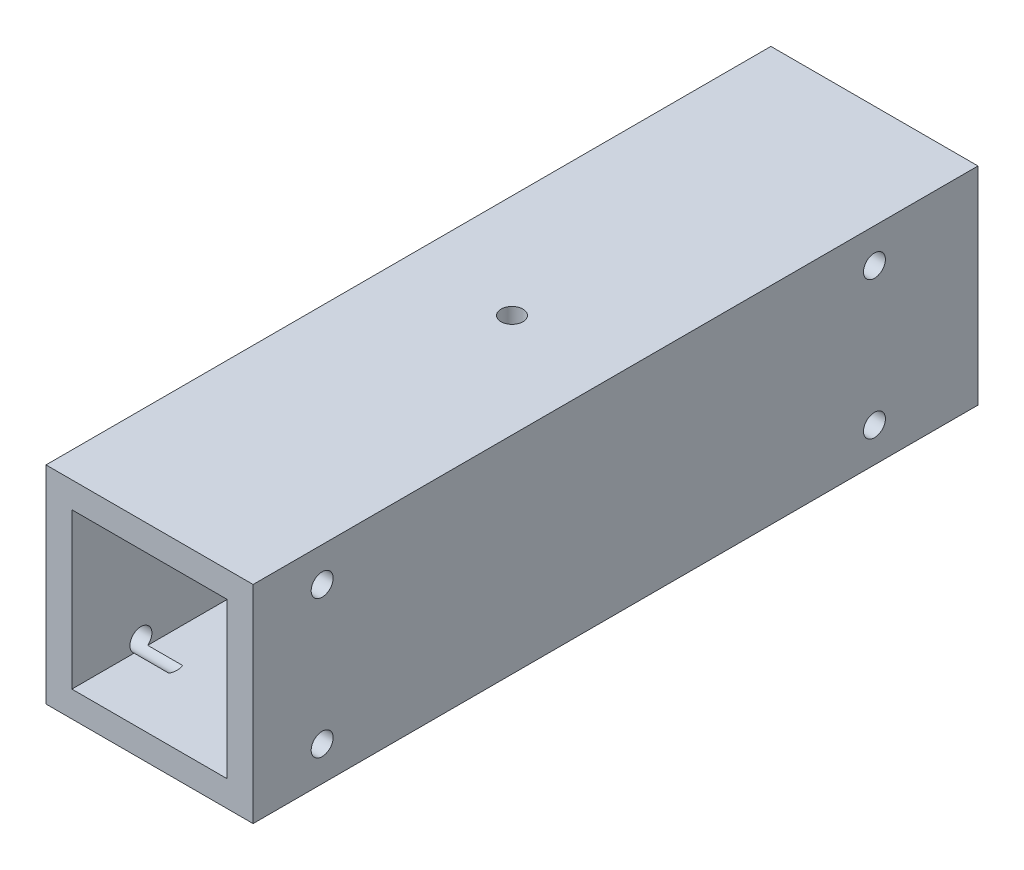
from build123d import *

# Parameters (mm, degrees)
SKETCH1_W                       = 38.1
SKETCH1_H                       = 133.35
BOSS_EXTRUDE1_DEPTH             = 19.05
SKETCH2_W                       = 28.575
SKETCH2_H                       = 28.575
CUT_EXTRUDE1_DEPTH              = 137.044211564
F_10_32_TAPPED_HOLE1_AT_2_COUNT = 2
F_10_32_TAPPED_HOLE1_AT_2_PITCH = 25.4
F_10_32_TAPPED_HOLE1_AT_3_COUNT = 2
F_10_32_TAPPED_HOLE1_AT_3_PITCH = 104.726882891
F_10_32_TAPPED_HOLE1_AT_4_COUNT = 2
F_10_32_TAPPED_HOLE1_AT_4_PITCH = 101.6
F_10_32_TAPPED_HOLE2_D          = 4.0386


with BuildPart() as part:
    # Sketch1 → Boss-Extrude1 (new, symmetric)
    with BuildSketch(Plane(origin=(0, 0, 0), x_dir=(1, 0, 0), z_dir=(0, 1, 0))):
        Rectangle(SKETCH1_W, SKETCH1_H)
    extrude(amount=BOSS_EXTRUDE1_DEPTH, both=True)

    # Sketch2 → Cut-Extrude1 (cut, through all)
    with BuildSketch(Plane.XY.offset(66.675)):
        Rectangle(SKETCH2_W, SKETCH2_H)
    extrude(amount=-CUT_EXTRUDE1_DEPTH, mode=Mode.SUBTRACT)

    # Sketch3 → 10-32 Tapped Hole1 (revolve, cut)
    with BuildSketch(Plane(origin=(19.05, -12.7, 53.975), x_dir=(0, 0, -1), z_dir=(0, 1, 0))):
        Polygon((0, 0), (0, 12.389317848), (2.0193, 11.176), (2.0193, 0), align=None)
    f_10_32_tapped_hole1 = revolve(axis=Axis((25.4, -12.7, 53.975), (-1, 0, 0)), mode=Mode.SUBTRACT)

    # 10-32 Tapped Hole1 at 2: 10-32 Tapped Hole1 ×2
    with Locations(*[(0, i * F_10_32_TAPPED_HOLE1_AT_2_PITCH, 0) for i in range(1, F_10_32_TAPPED_HOLE1_AT_2_COUNT)]):
        add(f_10_32_tapped_hole1, mode=Mode.SUBTRACT)

    # 10-32 Tapped Hole1 at 3: 10-32 Tapped Hole1 ×2
    with Locations(*[Vector(0, 0.24253562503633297, -0.9701425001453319) * (i * F_10_32_TAPPED_HOLE1_AT_3_PITCH) for i in range(1, F_10_32_TAPPED_HOLE1_AT_3_COUNT)]):
        add(f_10_32_tapped_hole1, mode=Mode.SUBTRACT)

    # 10-32 Tapped Hole1 at 4: 10-32 Tapped Hole1 ×2
    with Locations(*[(0, 0, -i * F_10_32_TAPPED_HOLE1_AT_4_PITCH) for i in range(1, F_10_32_TAPPED_HOLE1_AT_4_COUNT)]):
        add(f_10_32_tapped_hole1, mode=Mode.SUBTRACT)

    # 10-32 Tapped Hole2 (through all)
    with Locations(Plane(origin=(0, 19.05, 0), x_dir=(1, 0, 0), z_dir=(0, 1, 0))):
        with Locations((0, 0)):
            Hole(F_10_32_TAPPED_HOLE2_D / 2)

    # Mirror1: 10-32 Tapped Hole1 across plane
    add(f_10_32_tapped_hole1.mirror(Plane(origin=(0, 0, 0), x_dir=(0, 0, 1), z_dir=(1, 0, 0))), mode=Mode.SUBTRACT)

    # Mirror1 copy 1 sketch → Mirror1 copy 1 (revolve, cut)
    with BuildSketch(Plane(origin=(-19.05, 12.7, 53.975), x_dir=(0, 0, -1), z_dir=(0, 1, 0))):
        Polygon((0, 0), (0, -12.389317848), (2.0193, -11.176), (2.0193, 0), align=None)
    revolve(axis=Axis((-25.4, 12.7, 53.975), (-1, 0, 0)), mode=Mode.SUBTRACT)

    # Mirror1 copy 2 sketch → Mirror1 copy 2 (revolve, cut)
    with BuildSketch(Plane(origin=(-19.05, 12.7, -47.625), x_dir=(0, 0, -1), z_dir=(0, 1, 0))):
        Polygon((0, 0), (0, -12.389317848), (2.0193, -11.176), (2.0193, 0), align=None)
    revolve(axis=Axis((-25.4, 12.7, -47.625), (-1, 0, 0)), mode=Mode.SUBTRACT)

    # Mirror1 copy 3 sketch → Mirror1 copy 3 (revolve, cut)
    with BuildSketch(Plane(origin=(-19.05, -12.7, -47.625), x_dir=(0, 0, -1), z_dir=(0, 1, 0))):
        Polygon((0, 0), (0, -12.389317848), (2.0193, -11.176), (2.0193, 0), align=None)
    revolve(axis=Axis((-25.4, -12.7, -47.625), (-1, 0, 0)), mode=Mode.SUBTRACT)


solid = part.part
